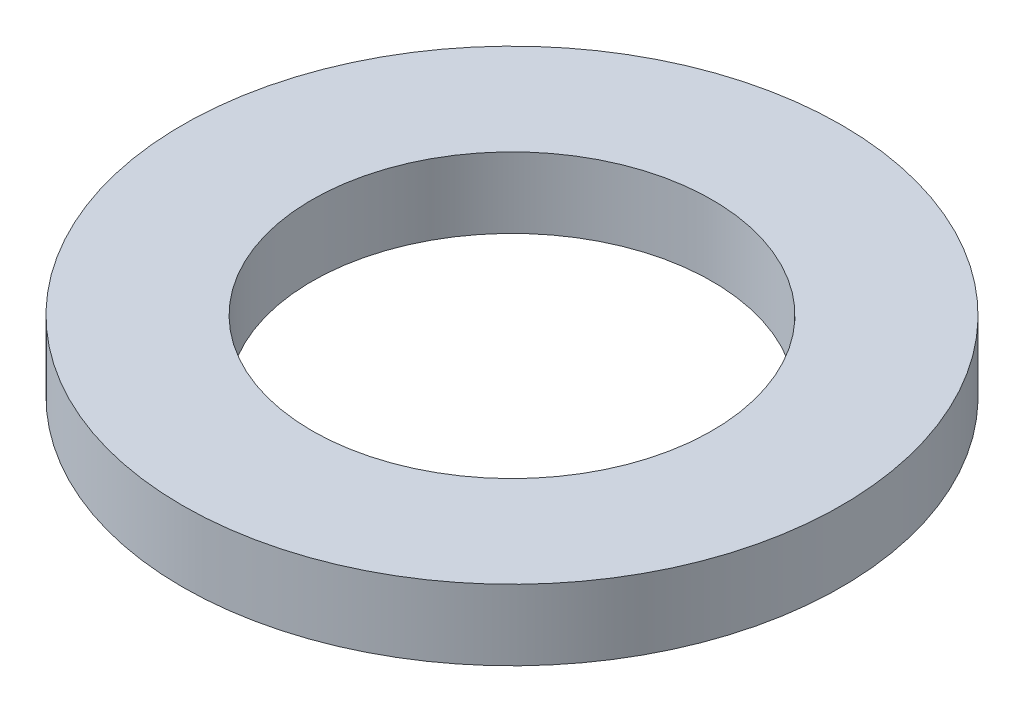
from build123d import *

# Parameters (mm, degrees)
SCHIZZO1_R                   = 7
SCHIZZO1_R_2                 = 4.25
ESTRUSIONE_ESTRUSIONE1_DEPTH = 1.5


with BuildPart() as part:
    # Schizzo1 → Estrusione-Estrusione1 (new body)
    with BuildSketch(Plane(origin=(0, 0, 0), x_dir=(1, 0, 0), z_dir=(0, 1, 0))):
        with Locations(Location((0, 0, 0), (0, 0, 270))):
            Circle(SCHIZZO1_R)
        with Locations(Location((0, 0, 0), (0, 0, 270))):
            Circle(SCHIZZO1_R_2, mode=Mode.SUBTRACT)
    extrude(amount=ESTRUSIONE_ESTRUSIONE1_DEPTH)


solid = part.part
